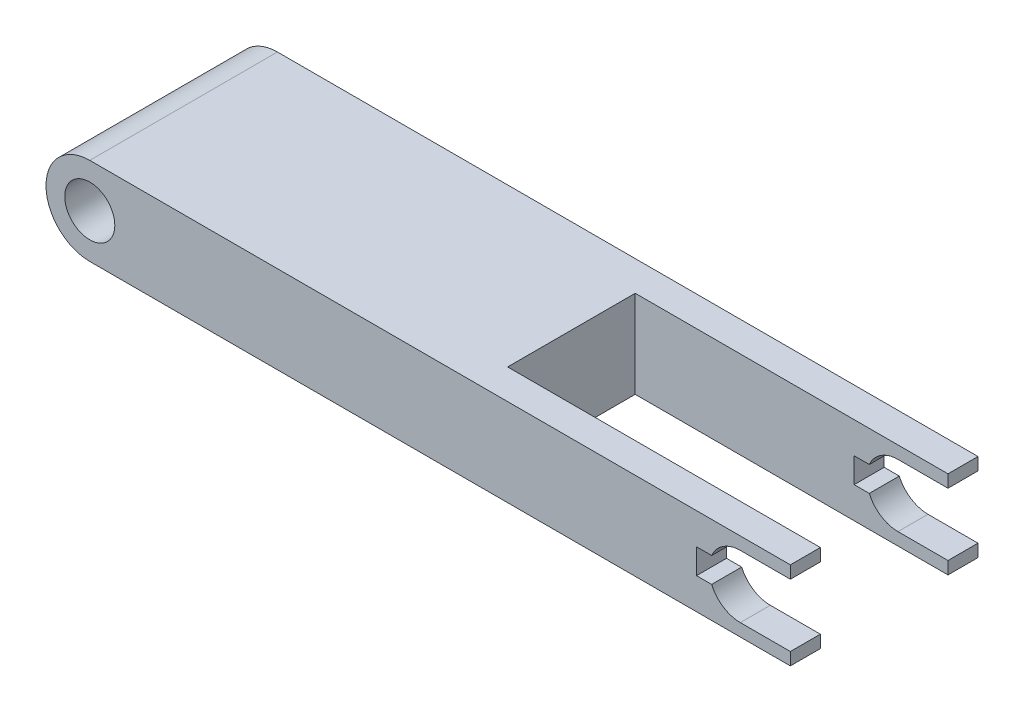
ISO-10303-21;
HEADER;
FILE_DESCRIPTION(('STEP AP214'),'2;1');
FILE_NAME('part.step','',(''),(''),'','','');
FILE_SCHEMA(('AUTOMOTIVE_DESIGN { 1 0 10303 214 1 1 1 1 }'));
ENDSEC;
DATA;
#1=APPLICATION_CONTEXT('core data for automotive mechanical design processes');
#2=APPLICATION_PROTOCOL_DEFINITION('international standard','automotive_design',2000,#1);
#3=PRODUCT_CONTEXT('',#1,'mechanical');
#4=PRODUCT('Part','Part','',(#3));
#5=PRODUCT_RELATED_PRODUCT_CATEGORY('part','',(#4));
#6=PRODUCT_DEFINITION_FORMATION('','',#4);
#7=PRODUCT_DEFINITION_CONTEXT('part definition',#1,'design');
#8=PRODUCT_DEFINITION('design','',#6,#7);
#9=PRODUCT_DEFINITION_SHAPE('','',#8);
#10=(LENGTH_UNIT() NAMED_UNIT(*) SI_UNIT(.MILLI.,.METRE.));
#11=(NAMED_UNIT(*) PLANE_ANGLE_UNIT() SI_UNIT($,.RADIAN.));
#12=(NAMED_UNIT(*) SI_UNIT($,.STERADIAN.) SOLID_ANGLE_UNIT());
#13=UNCERTAINTY_MEASURE_WITH_UNIT(LENGTH_MEASURE(1.E-05),#10,'distance_accuracy_value','');
#14=(GEOMETRIC_REPRESENTATION_CONTEXT(3) GLOBAL_UNCERTAINTY_ASSIGNED_CONTEXT((#13)) GLOBAL_UNIT_ASSIGNED_CONTEXT((#10,
#11,#12)) REPRESENTATION_CONTEXT('',''));
#15=CARTESIAN_POINT('',(0.,0.,0.));
#16=DIRECTION('',(0.,0.,1.));
#17=DIRECTION('',(1.,0.,0.));
#18=AXIS2_PLACEMENT_3D('',#15,#16,#17);
#19=CARTESIAN_POINT('',(26.,0.,-7.5));
#20=DIRECTION('',(0.,0.,1.));
#21=DIRECTION('',(1.,0.,0.));
#22=AXIS2_PLACEMENT_3D('',#19,#20,#21);
#23=CYLINDRICAL_SURFACE('',#22,2.5);
#24=CARTESIAN_POINT('',(26.,0.,7.5));
#25=DIRECTION('',(0.,0.,1.));
#26=DIRECTION('',(1.,0.,0.));
#27=AXIS2_PLACEMENT_3D('',#24,#25,#26);
#28=CIRCLE('',#27,2.5);
#29=CARTESIAN_POINT('',(26.,2.49999999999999,7.5));
#30=VERTEX_POINT('',#29);
#31=CARTESIAN_POINT('',(23.7087121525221,1.,7.5));
#32=VERTEX_POINT('',#31);
#33=EDGE_CURVE('E331',#30,#32,#28,.T.);
#34=ORIENTED_EDGE('',*,*,#33,.T.);
#35=DIRECTION('',(0.,0.,1.));
#36=VECTOR('',#35,1.);
#37=CARTESIAN_POINT('',(23.7087121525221,1.,-7.5));
#38=LINE('',#37,#36);
#39=CARTESIAN_POINT('',(23.7087121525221,1.,5.1));
#40=VERTEX_POINT('',#39);
#41=EDGE_CURVE('E317',#32,#40,#38,.F.);
#42=ORIENTED_EDGE('',*,*,#41,.T.);
#43=CARTESIAN_POINT('',(26.,0.,5.1));
#44=DIRECTION('',(0.,0.,1.));
#45=DIRECTION('',(1.,0.,0.));
#46=AXIS2_PLACEMENT_3D('',#43,#44,#45);
#47=CIRCLE('',#46,2.5);
#48=CARTESIAN_POINT('',(26.,2.49999999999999,5.1));
#49=VERTEX_POINT('',#48);
#50=EDGE_CURVE('E381',#49,#40,#47,.T.);
#51=ORIENTED_EDGE('',*,*,#50,.F.);
#52=DIRECTION('',(0.,0.,1.));
#53=VECTOR('',#52,1.);
#54=CARTESIAN_POINT('',(26.,2.49999999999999,-7.5));
#55=LINE('',#54,#53);
#56=EDGE_CURVE('E329',#30,#49,#55,.F.);
#57=ORIENTED_EDGE('',*,*,#56,.F.);
#58=EDGE_LOOP('',(#34,#42,#51,#57));
#59=FACE_BOUND('',#58,.T.);
#60=ADVANCED_FACE('F34',(#59),#23,.F.);
#61=CARTESIAN_POINT('',(26.,0.,-5.1));
#62=DIRECTION('',(0.,0.,1.));
#63=DIRECTION('',(1.,0.,0.));
#64=AXIS2_PLACEMENT_3D('',#61,#62,#63);
#65=CIRCLE('',#64,2.5);
#66=CARTESIAN_POINT('',(26.,2.49999999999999,-5.1));
#67=VERTEX_POINT('',#66);
#68=CARTESIAN_POINT('',(23.7087121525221,1.,-5.1));
#69=VERTEX_POINT('',#68);
#70=EDGE_CURVE('E340',#67,#69,#65,.T.);
#71=ORIENTED_EDGE('',*,*,#70,.T.);
#72=DIRECTION('',(0.,0.,1.));
#73=VECTOR('',#72,1.);
#74=CARTESIAN_POINT('',(23.7087121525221,1.,-7.5));
#75=LINE('',#74,#73);
#76=CARTESIAN_POINT('',(23.7087121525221,1.,-7.5));
#77=VERTEX_POINT('',#76);
#78=EDGE_CURVE('E42',#69,#77,#75,.F.);
#79=ORIENTED_EDGE('',*,*,#78,.T.);
#80=CARTESIAN_POINT('',(26.,0.,-7.5));
#81=DIRECTION('',(0.,0.,1.));
#82=DIRECTION('',(1.,0.,0.));
#83=AXIS2_PLACEMENT_3D('',#80,#81,#82);
#84=CIRCLE('',#83,2.5);
#85=CARTESIAN_POINT('',(26.,2.49999999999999,-7.5));
#86=VERTEX_POINT('',#85);
#87=EDGE_CURVE('E326',#86,#77,#84,.T.);
#88=ORIENTED_EDGE('',*,*,#87,.F.);
#89=DIRECTION('',(0.,0.,1.));
#90=VECTOR('',#89,1.);
#91=CARTESIAN_POINT('',(26.,2.49999999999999,-7.5));
#92=LINE('',#91,#90);
#93=EDGE_CURVE('E343',#67,#86,#92,.F.);
#94=ORIENTED_EDGE('',*,*,#93,.F.);
#95=EDGE_LOOP('',(#71,#79,#88,#94));
#96=FACE_BOUND('',#95,.T.);
#97=ADVANCED_FACE('F388',(#96),#23,.F.);
#98=CARTESIAN_POINT('',(26.,-3.5,7.5));
#99=DIRECTION('',(0.,1.,0.));
#100=DIRECTION('',(-1.,0.,0.));
#101=AXIS2_PLACEMENT_3D('',#98,#99,#100);
#102=PLANE('',#101);
#103=DIRECTION('',(-1.,0.,0.));
#104=VECTOR('',#103,1.);
#105=CARTESIAN_POINT('',(0.,-3.5,-5.1));
#106=LINE('',#105,#104);
#107=CARTESIAN_POINT('',(30.,-3.5,-5.1));
#108=VERTEX_POINT('',#107);
#109=CARTESIAN_POINT('',(4.99999999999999,-3.5,-5.1));
#110=VERTEX_POINT('',#109);
#111=EDGE_CURVE('E209',#108,#110,#106,.T.);
#112=ORIENTED_EDGE('',*,*,#111,.T.);
#113=DIRECTION('',(0.,0.,1.));
#114=VECTOR('',#113,1.);
#115=CARTESIAN_POINT('',(4.99999999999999,-3.5,-5.1));
#116=LINE('',#115,#114);
#117=CARTESIAN_POINT('',(4.99999999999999,-3.5,5.1));
#118=VERTEX_POINT('',#117);
#119=EDGE_CURVE('E208',#110,#118,#116,.T.);
#120=ORIENTED_EDGE('',*,*,#119,.T.);
#121=DIRECTION('',(-1.,0.,0.));
#122=VECTOR('',#121,1.);
#123=CARTESIAN_POINT('',(0.,-3.5,5.1));
#124=LINE('',#123,#122);
#125=CARTESIAN_POINT('',(30.,-3.5,5.1));
#126=VERTEX_POINT('',#125);
#127=EDGE_CURVE('E360',#126,#118,#124,.T.);
#128=ORIENTED_EDGE('',*,*,#127,.F.);
#129=DIRECTION('',(0.,0.,-1.));
#130=VECTOR('',#129,1.);
#131=CARTESIAN_POINT('',(30.,-3.5,7.5));
#132=LINE('',#131,#130);
#133=CARTESIAN_POINT('',(30.,-3.5,7.5));
#134=VERTEX_POINT('',#133);
#135=EDGE_CURVE('E254',#134,#126,#132,.T.);
#136=ORIENTED_EDGE('',*,*,#135,.F.);
#137=DIRECTION('',(1.,0.,0.));
#138=VECTOR('',#137,1.);
#139=CARTESIAN_POINT('',(26.,-3.5,7.5));
#140=LINE('',#139,#138);
#141=CARTESIAN_POINT('',(-26.,-3.5,7.5));
#142=VERTEX_POINT('',#141);
#143=EDGE_CURVE('E367',#142,#134,#140,.T.);
#144=ORIENTED_EDGE('',*,*,#143,.F.);
#145=DIRECTION('',(0.,0.,-1.));
#146=VECTOR('',#145,1.);
#147=CARTESIAN_POINT('',(-26.,-3.5,7.5));
#148=LINE('',#147,#146);
#149=CARTESIAN_POINT('',(-26.,-3.5,-7.5));
#150=VERTEX_POINT('',#149);
#151=EDGE_CURVE('E377',#142,#150,#148,.T.);
#152=ORIENTED_EDGE('',*,*,#151,.T.);
#153=DIRECTION('',(1.,0.,0.));
#154=VECTOR('',#153,1.);
#155=CARTESIAN_POINT('',(26.,-3.5,-7.5));
#156=LINE('',#155,#154);
#157=CARTESIAN_POINT('',(30.,-3.5,-7.5));
#158=VERTEX_POINT('',#157);
#159=EDGE_CURVE('E364',#150,#158,#156,.T.);
#160=ORIENTED_EDGE('',*,*,#159,.T.);
#161=DIRECTION('',(0.,0.,-1.));
#162=VECTOR('',#161,1.);
#163=CARTESIAN_POINT('',(30.,-3.5,-5.1));
#164=LINE('',#163,#162);
#165=EDGE_CURVE('E238',#108,#158,#164,.T.);
#166=ORIENTED_EDGE('',*,*,#165,.F.);
#167=EDGE_LOOP('',(#112,#120,#128,#136,#144,#152,#160,#166));
#168=FACE_BOUND('',#167,.T.);
#169=ADVANCED_FACE('F36',(#168),#102,.F.);
#170=CARTESIAN_POINT('',(26.,3.5,7.5));
#171=DIRECTION('',(0.,-1.,0.));
#172=DIRECTION('',(1.,0.,0.));
#173=AXIS2_PLACEMENT_3D('',#170,#171,#172);
#174=PLANE('',#173);
#175=DIRECTION('',(-1.,0.,0.));
#176=VECTOR('',#175,1.);
#177=CARTESIAN_POINT('',(0.,3.5,-5.1));
#178=LINE('',#177,#176);
#179=CARTESIAN_POINT('',(30.,3.5,-5.1));
#180=VERTEX_POINT('',#179);
#181=CARTESIAN_POINT('',(4.99999999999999,3.5,-5.1));
#182=VERTEX_POINT('',#181);
#183=EDGE_CURVE('E197',#180,#182,#178,.T.);
#184=ORIENTED_EDGE('',*,*,#183,.F.);
#185=DIRECTION('',(0.,0.,1.));
#186=VECTOR('',#185,1.);
#187=CARTESIAN_POINT('',(30.,3.5,-7.5));
#188=LINE('',#187,#186);
#189=CARTESIAN_POINT('',(30.,3.5,-7.5));
#190=VERTEX_POINT('',#189);
#191=EDGE_CURVE('E202',#190,#180,#188,.T.);
#192=ORIENTED_EDGE('',*,*,#191,.F.);
#193=DIRECTION('',(-1.,0.,0.));
#194=VECTOR('',#193,1.);
#195=CARTESIAN_POINT('',(26.,3.5,-7.5));
#196=LINE('',#195,#194);
#197=CARTESIAN_POINT('',(-26.,3.5,-7.5));
#198=VERTEX_POINT('',#197);
#199=EDGE_CURVE('E370',#190,#198,#196,.T.);
#200=ORIENTED_EDGE('',*,*,#199,.T.);
#201=DIRECTION('',(0.,0.,-1.));
#202=VECTOR('',#201,1.);
#203=CARTESIAN_POINT('',(-26.,3.5,7.5));
#204=LINE('',#203,#202);
#205=CARTESIAN_POINT('',(-26.,3.5,7.5));
#206=VERTEX_POINT('',#205);
#207=EDGE_CURVE('E373',#206,#198,#204,.T.);
#208=ORIENTED_EDGE('',*,*,#207,.F.);
#209=DIRECTION('',(-1.,0.,0.));
#210=VECTOR('',#209,1.);
#211=CARTESIAN_POINT('',(26.,3.5,7.5));
#212=LINE('',#211,#210);
#213=CARTESIAN_POINT('',(30.,3.5,7.5));
#214=VERTEX_POINT('',#213);
#215=EDGE_CURVE('E369',#214,#206,#212,.T.);
#216=ORIENTED_EDGE('',*,*,#215,.F.);
#217=DIRECTION('',(0.,0.,1.));
#218=VECTOR('',#217,1.);
#219=CARTESIAN_POINT('',(30.,3.5,5.1));
#220=LINE('',#219,#218);
#221=CARTESIAN_POINT('',(30.,3.5,5.1));
#222=VERTEX_POINT('',#221);
#223=EDGE_CURVE('E270',#222,#214,#220,.T.);
#224=ORIENTED_EDGE('',*,*,#223,.F.);
#225=DIRECTION('',(-1.,0.,0.));
#226=VECTOR('',#225,1.);
#227=CARTESIAN_POINT('',(0.,3.5,5.1));
#228=LINE('',#227,#226);
#229=CARTESIAN_POINT('',(5.,3.5,5.1));
#230=VERTEX_POINT('',#229);
#231=EDGE_CURVE('E355',#222,#230,#228,.T.);
#232=ORIENTED_EDGE('',*,*,#231,.T.);
#233=DIRECTION('',(0.,0.,1.));
#234=VECTOR('',#233,1.);
#235=CARTESIAN_POINT('',(4.99999999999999,3.5,-5.1));
#236=LINE('',#235,#234);
#237=EDGE_CURVE('E205',#182,#230,#236,.T.);
#238=ORIENTED_EDGE('',*,*,#237,.F.);
#239=EDGE_LOOP('',(#184,#192,#200,#208,#216,#224,#232,#238));
#240=FACE_BOUND('',#239,.T.);
#241=ADVANCED_FACE('F199',(#240),#174,.F.);
#242=CARTESIAN_POINT('',(0.,0.,7.5));
#243=DIRECTION('',(0.,0.,-1.));
#244=DIRECTION('',(-1.,0.,0.));
#245=AXIS2_PLACEMENT_3D('',#242,#243,#244);
#246=PLANE('',#245);
#247=CARTESIAN_POINT('',(-26.,0.,7.5));
#248=DIRECTION('',(0.,0.,1.));
#249=DIRECTION('',(1.,0.,0.));
#250=AXIS2_PLACEMENT_3D('',#247,#248,#249);
#251=CIRCLE('',#250,2.);
#252=CARTESIAN_POINT('',(-24.,0.,7.5));
#253=VERTEX_POINT('',#252);
#254=EDGE_CURVE('E228',#253,#253,#251,.T.);
#255=ORIENTED_EDGE('',*,*,#254,.F.);
#256=EDGE_LOOP('',(#255));
#257=FACE_BOUND('',#256,.T.);
#258=DIRECTION('',(0.,-1.,0.));
#259=VECTOR('',#258,1.);
#260=CARTESIAN_POINT('',(22.5,1.,7.5));
#261=LINE('',#260,#259);
#262=CARTESIAN_POINT('',(22.5,1.,7.5));
#263=VERTEX_POINT('',#262);
#264=CARTESIAN_POINT('',(22.5,-0.999999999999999,7.5));
#265=VERTEX_POINT('',#264);
#266=EDGE_CURVE('E286',#263,#265,#261,.T.);
#267=ORIENTED_EDGE('',*,*,#266,.F.);
#268=DIRECTION('',(-1.,0.,0.));
#269=VECTOR('',#268,1.);
#270=CARTESIAN_POINT('',(24.5,1.,7.5));
#271=LINE('',#270,#269);
#272=EDGE_CURVE('E291',#32,#263,#271,.T.);
#273=ORIENTED_EDGE('',*,*,#272,.F.);
#274=ORIENTED_EDGE('',*,*,#33,.F.);
#275=DIRECTION('',(-1.,0.,0.));
#276=VECTOR('',#275,1.);
#277=CARTESIAN_POINT('',(30.,2.49999999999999,7.5));
#278=LINE('',#277,#276);
#279=CARTESIAN_POINT('',(30.,2.49999999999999,7.5));
#280=VERTEX_POINT('',#279);
#281=EDGE_CURVE('E283',#280,#30,#278,.T.);
#282=ORIENTED_EDGE('',*,*,#281,.F.);
#283=DIRECTION('',(0.,-1.,0.));
#284=VECTOR('',#283,1.);
#285=CARTESIAN_POINT('',(30.,3.5,7.5));
#286=LINE('',#285,#284);
#287=EDGE_CURVE('E273',#214,#280,#286,.T.);
#288=ORIENTED_EDGE('',*,*,#287,.F.);
#289=ORIENTED_EDGE('',*,*,#215,.T.);
#290=CARTESIAN_POINT('',(-26.,0.,7.5));
#291=DIRECTION('',(0.,0.,1.));
#292=DIRECTION('',(1.,0.,0.));
#293=AXIS2_PLACEMENT_3D('',#290,#291,#292);
#294=CIRCLE('',#293,3.5);
#295=EDGE_CURVE('E348',#206,#142,#294,.T.);
#296=ORIENTED_EDGE('',*,*,#295,.T.);
#297=ORIENTED_EDGE('',*,*,#143,.T.);
#298=DIRECTION('',(0.,-1.,0.));
#299=VECTOR('',#298,1.);
#300=CARTESIAN_POINT('',(30.,-2.50000000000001,7.5));
#301=LINE('',#300,#299);
#302=CARTESIAN_POINT('',(30.,-2.50000000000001,7.5));
#303=VERTEX_POINT('',#302);
#304=EDGE_CURVE('E261',#303,#134,#301,.T.);
#305=ORIENTED_EDGE('',*,*,#304,.F.);
#306=DIRECTION('',(-1.,0.,0.));
#307=VECTOR('',#306,1.);
#308=CARTESIAN_POINT('',(30.,-2.50000000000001,7.5));
#309=LINE('',#308,#307);
#310=CARTESIAN_POINT('',(26.,-2.50000000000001,7.5));
#311=VERTEX_POINT('',#310);
#312=EDGE_CURVE('E264',#303,#311,#309,.T.);
#313=ORIENTED_EDGE('',*,*,#312,.T.);
#314=CARTESIAN_POINT('',(23.7087121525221,-0.999999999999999,7.5));
#315=VERTEX_POINT('',#314);
#316=EDGE_CURVE('E325',#315,#311,#28,.T.);
#317=ORIENTED_EDGE('',*,*,#316,.F.);
#318=DIRECTION('',(1.,0.,0.));
#319=VECTOR('',#318,1.);
#320=CARTESIAN_POINT('',(24.5,-0.999999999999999,7.5));
#321=LINE('',#320,#319);
#322=EDGE_CURVE('E49',#265,#315,#321,.T.);
#323=ORIENTED_EDGE('',*,*,#322,.F.);
#324=EDGE_LOOP('',(#267,#273,#274,#282,#288,#289,#296,#297,#305,#313,#317,#323));
#325=FACE_BOUND('',#324,.T.);
#326=ADVANCED_FACE('F431',(#257,#325),#246,.F.);
#327=CARTESIAN_POINT('',(0.,0.,-7.5));
#328=DIRECTION('',(0.,0.,-1.));
#329=DIRECTION('',(-1.,0.,0.));
#330=AXIS2_PLACEMENT_3D('',#327,#328,#329);
#331=PLANE('',#330);
#332=CARTESIAN_POINT('',(-26.,0.,-7.5));
#333=DIRECTION('',(0.,0.,1.));
#334=DIRECTION('',(1.,0.,0.));
#335=AXIS2_PLACEMENT_3D('',#332,#333,#334);
#336=CIRCLE('',#335,2.);
#337=CARTESIAN_POINT('',(-24.,0.,-7.5));
#338=VERTEX_POINT('',#337);
#339=EDGE_CURVE('E225',#338,#338,#336,.T.);
#340=ORIENTED_EDGE('',*,*,#339,.T.);
#341=EDGE_LOOP('',(#340));
#342=FACE_BOUND('',#341,.T.);
#343=DIRECTION('',(-1.,0.,0.));
#344=VECTOR('',#343,1.);
#345=CARTESIAN_POINT('',(24.5,1.,-7.5));
#346=LINE('',#345,#344);
#347=CARTESIAN_POINT('',(22.5,1.,-7.5));
#348=VERTEX_POINT('',#347);
#349=EDGE_CURVE('E294',#77,#348,#346,.T.);
#350=ORIENTED_EDGE('',*,*,#349,.T.);
#351=DIRECTION('',(0.,-1.,0.));
#352=VECTOR('',#351,1.);
#353=CARTESIAN_POINT('',(22.5,1.,-7.5));
#354=LINE('',#353,#352);
#355=CARTESIAN_POINT('',(22.5,-0.999999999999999,-7.5));
#356=VERTEX_POINT('',#355);
#357=EDGE_CURVE('E287',#348,#356,#354,.T.);
#358=ORIENTED_EDGE('',*,*,#357,.T.);
#359=DIRECTION('',(1.,0.,0.));
#360=VECTOR('',#359,1.);
#361=CARTESIAN_POINT('',(24.5,-0.999999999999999,-7.5));
#362=LINE('',#361,#360);
#363=CARTESIAN_POINT('',(23.7087121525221,-0.999999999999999,-7.5));
#364=VERTEX_POINT('',#363);
#365=EDGE_CURVE('E290',#356,#364,#362,.T.);
#366=ORIENTED_EDGE('',*,*,#365,.T.);
#367=CARTESIAN_POINT('',(26.,-2.50000000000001,-7.5));
#368=VERTEX_POINT('',#367);
#369=EDGE_CURVE('E330',#364,#368,#84,.T.);
#370=ORIENTED_EDGE('',*,*,#369,.T.);
#371=DIRECTION('',(-1.,0.,0.));
#372=VECTOR('',#371,1.);
#373=CARTESIAN_POINT('',(30.,-2.50000000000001,-7.5));
#374=LINE('',#373,#372);
#375=CARTESIAN_POINT('',(30.,-2.50000000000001,-7.5));
#376=VERTEX_POINT('',#375);
#377=EDGE_CURVE('E251',#376,#368,#374,.T.);
#378=ORIENTED_EDGE('',*,*,#377,.F.);
#379=DIRECTION('',(0.,1.,0.));
#380=VECTOR('',#379,1.);
#381=CARTESIAN_POINT('',(30.,-3.5,-7.5));
#382=LINE('',#381,#380);
#383=EDGE_CURVE('E241',#158,#376,#382,.T.);
#384=ORIENTED_EDGE('',*,*,#383,.F.);
#385=ORIENTED_EDGE('',*,*,#159,.F.);
#386=CARTESIAN_POINT('',(-26.,0.,-7.5));
#387=DIRECTION('',(0.,0.,1.));
#388=DIRECTION('',(1.,0.,0.));
#389=AXIS2_PLACEMENT_3D('',#386,#387,#388);
#390=CIRCLE('',#389,3.5);
#391=EDGE_CURVE('E349',#198,#150,#390,.T.);
#392=ORIENTED_EDGE('',*,*,#391,.F.);
#393=ORIENTED_EDGE('',*,*,#199,.F.);
#394=DIRECTION('',(0.,1.,0.));
#395=VECTOR('',#394,1.);
#396=CARTESIAN_POINT('',(30.,2.49999999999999,-7.5));
#397=LINE('',#396,#395);
#398=CARTESIAN_POINT('',(30.,2.49999999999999,-7.5));
#399=VERTEX_POINT('',#398);
#400=EDGE_CURVE('E224',#399,#190,#397,.T.);
#401=ORIENTED_EDGE('',*,*,#400,.F.);
#402=DIRECTION('',(-1.,0.,0.));
#403=VECTOR('',#402,1.);
#404=CARTESIAN_POINT('',(30.,2.49999999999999,-7.5));
#405=LINE('',#404,#403);
#406=EDGE_CURVE('E234',#399,#86,#405,.T.);
#407=ORIENTED_EDGE('',*,*,#406,.T.);
#408=ORIENTED_EDGE('',*,*,#87,.T.);
#409=EDGE_LOOP('',(#350,#358,#366,#370,#378,#384,#385,#392,#393,#401,#407,#408));
#410=FACE_BOUND('',#409,.T.);
#411=ADVANCED_FACE('F392',(#342,#410),#331,.T.);
#412=CARTESIAN_POINT('',(0.,0.,-5.1));
#413=DIRECTION('',(0.,0.,1.));
#414=DIRECTION('',(1.,0.,0.));
#415=AXIS2_PLACEMENT_3D('',#412,#413,#414);
#416=PLANE('',#415);
#417=DIRECTION('',(-1.,0.,0.));
#418=VECTOR('',#417,1.);
#419=CARTESIAN_POINT('',(0.,0.999999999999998,-5.1));
#420=LINE('',#419,#418);
#421=CARTESIAN_POINT('',(22.5,1.,-5.1));
#422=VERTEX_POINT('',#421);
#423=EDGE_CURVE('E315',#69,#422,#420,.T.);
#424=ORIENTED_EDGE('',*,*,#423,.F.);
#425=ORIENTED_EDGE('',*,*,#70,.F.);
#426=DIRECTION('',(-1.,0.,0.));
#427=VECTOR('',#426,1.);
#428=CARTESIAN_POINT('',(30.,2.49999999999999,-5.1));
#429=LINE('',#428,#427);
#430=CARTESIAN_POINT('',(30.,2.49999999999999,-5.1));
#431=VERTEX_POINT('',#430);
#432=EDGE_CURVE('E216',#431,#67,#429,.T.);
#433=ORIENTED_EDGE('',*,*,#432,.F.);
#434=DIRECTION('',(0.,-1.,0.));
#435=VECTOR('',#434,1.);
#436=CARTESIAN_POINT('',(30.,3.5,-5.1));
#437=LINE('',#436,#435);
#438=EDGE_CURVE('E212',#180,#431,#437,.T.);
#439=ORIENTED_EDGE('',*,*,#438,.F.);
#440=ORIENTED_EDGE('',*,*,#183,.T.);
#441=DIRECTION('',(0.,-1.,0.));
#442=VECTOR('',#441,1.);
#443=CARTESIAN_POINT('',(4.99999999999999,0.,-5.1));
#444=LINE('',#443,#442);
#445=EDGE_CURVE('E353',#182,#110,#444,.T.);
#446=ORIENTED_EDGE('',*,*,#445,.T.);
#447=ORIENTED_EDGE('',*,*,#111,.F.);
#448=DIRECTION('',(0.,-1.,0.));
#449=VECTOR('',#448,1.);
#450=CARTESIAN_POINT('',(30.,-2.50000000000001,-5.1));
#451=LINE('',#450,#449);
#452=CARTESIAN_POINT('',(30.,-2.50000000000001,-5.1));
#453=VERTEX_POINT('',#452);
#454=EDGE_CURVE('E245',#453,#108,#451,.T.);
#455=ORIENTED_EDGE('',*,*,#454,.F.);
#456=DIRECTION('',(-1.,0.,0.));
#457=VECTOR('',#456,1.);
#458=CARTESIAN_POINT('',(30.,-2.50000000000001,-5.1));
#459=LINE('',#458,#457);
#460=CARTESIAN_POINT('',(26.,-2.50000000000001,-5.1));
#461=VERTEX_POINT('',#460);
#462=EDGE_CURVE('E248',#453,#461,#459,.T.);
#463=ORIENTED_EDGE('',*,*,#462,.T.);
#464=CARTESIAN_POINT('',(23.7087121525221,-0.999999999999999,-5.1));
#465=VERTEX_POINT('',#464);
#466=EDGE_CURVE('E339',#465,#461,#65,.T.);
#467=ORIENTED_EDGE('',*,*,#466,.F.);
#468=DIRECTION('',(1.,0.,0.));
#469=VECTOR('',#468,1.);
#470=CARTESIAN_POINT('',(0.,-0.999999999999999,-5.1));
#471=LINE('',#470,#469);
#472=CARTESIAN_POINT('',(22.5,-0.999999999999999,-5.1));
#473=VERTEX_POINT('',#472);
#474=EDGE_CURVE('E57',#473,#465,#471,.T.);
#475=ORIENTED_EDGE('',*,*,#474,.F.);
#476=DIRECTION('',(0.,-1.,0.));
#477=VECTOR('',#476,1.);
#478=CARTESIAN_POINT('',(22.5,0.,-5.1));
#479=LINE('',#478,#477);
#480=EDGE_CURVE('E323',#422,#473,#479,.T.);
#481=ORIENTED_EDGE('',*,*,#480,.F.);
#482=EDGE_LOOP('',(#424,#425,#433,#439,#440,#446,#447,#455,#463,#467,#475,#481));
#483=FACE_BOUND('',#482,.T.);
#484=ADVANCED_FACE('F214',(#483),#416,.T.);
#485=CARTESIAN_POINT('',(0.,0.,5.1));
#486=DIRECTION('',(0.,0.,1.));
#487=DIRECTION('',(1.,0.,0.));
#488=AXIS2_PLACEMENT_3D('',#485,#486,#487);
#489=PLANE('',#488);
#490=ORIENTED_EDGE('',*,*,#50,.T.);
#491=DIRECTION('',(-1.,0.,0.));
#492=VECTOR('',#491,1.);
#493=CARTESIAN_POINT('',(0.,0.999999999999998,5.1));
#494=LINE('',#493,#492);
#495=CARTESIAN_POINT('',(22.5,1.,5.1));
#496=VERTEX_POINT('',#495);
#497=EDGE_CURVE('E320',#40,#496,#494,.T.);
#498=ORIENTED_EDGE('',*,*,#497,.T.);
#499=DIRECTION('',(0.,-1.,0.));
#500=VECTOR('',#499,1.);
#501=CARTESIAN_POINT('',(22.5,0.,5.1));
#502=LINE('',#501,#500);
#503=CARTESIAN_POINT('',(22.5,-0.999999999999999,5.1));
#504=VERTEX_POINT('',#503);
#505=EDGE_CURVE('E11',#496,#504,#502,.T.);
#506=ORIENTED_EDGE('',*,*,#505,.T.);
#507=DIRECTION('',(1.,0.,0.));
#508=VECTOR('',#507,1.);
#509=CARTESIAN_POINT('',(0.,-0.999999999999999,5.1));
#510=LINE('',#509,#508);
#511=CARTESIAN_POINT('',(23.7087121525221,-0.999999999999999,5.1));
#512=VERTEX_POINT('',#511);
#513=EDGE_CURVE('E312',#504,#512,#510,.T.);
#514=ORIENTED_EDGE('',*,*,#513,.T.);
#515=CARTESIAN_POINT('',(26.,-2.50000000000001,5.1));
#516=VERTEX_POINT('',#515);
#517=EDGE_CURVE('E380',#512,#516,#47,.T.);
#518=ORIENTED_EDGE('',*,*,#517,.T.);
#519=DIRECTION('',(-1.,0.,0.));
#520=VECTOR('',#519,1.);
#521=CARTESIAN_POINT('',(30.,-2.50000000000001,5.1));
#522=LINE('',#521,#520);
#523=CARTESIAN_POINT('',(30.,-2.50000000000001,5.1));
#524=VERTEX_POINT('',#523);
#525=EDGE_CURVE('E267',#524,#516,#522,.T.);
#526=ORIENTED_EDGE('',*,*,#525,.F.);
#527=DIRECTION('',(0.,1.,0.));
#528=VECTOR('',#527,1.);
#529=CARTESIAN_POINT('',(30.,-3.5,5.1));
#530=LINE('',#529,#528);
#531=EDGE_CURVE('E257',#126,#524,#530,.T.);
#532=ORIENTED_EDGE('',*,*,#531,.F.);
#533=ORIENTED_EDGE('',*,*,#127,.T.);
#534=DIRECTION('',(0.,-1.,0.));
#535=VECTOR('',#534,1.);
#536=CARTESIAN_POINT('',(4.99999999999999,0.,5.1));
#537=LINE('',#536,#535);
#538=EDGE_CURVE('E351',#230,#118,#537,.T.);
#539=ORIENTED_EDGE('',*,*,#538,.F.);
#540=ORIENTED_EDGE('',*,*,#231,.F.);
#541=DIRECTION('',(0.,1.,0.));
#542=VECTOR('',#541,1.);
#543=CARTESIAN_POINT('',(30.,2.49999999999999,5.1));
#544=LINE('',#543,#542);
#545=CARTESIAN_POINT('',(30.,2.49999999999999,5.1));
#546=VERTEX_POINT('',#545);
#547=EDGE_CURVE('E277',#546,#222,#544,.T.);
#548=ORIENTED_EDGE('',*,*,#547,.F.);
#549=DIRECTION('',(-1.,0.,0.));
#550=VECTOR('',#549,1.);
#551=CARTESIAN_POINT('',(30.,2.49999999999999,5.1));
#552=LINE('',#551,#550);
#553=EDGE_CURVE('E280',#546,#49,#552,.T.);
#554=ORIENTED_EDGE('',*,*,#553,.T.);
#555=EDGE_LOOP('',(#490,#498,#506,#514,#518,#526,#532,#533,#539,#540,#548,#554));
#556=FACE_BOUND('',#555,.T.);
#557=ADVANCED_FACE('F439',(#556),#489,.F.);
#558=CARTESIAN_POINT('',(4.99999999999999,0.,-5.1));
#559=DIRECTION('',(-1.,0.,0.));
#560=DIRECTION('',(0.,-1.,0.));
#561=AXIS2_PLACEMENT_3D('',#558,#559,#560);
#562=PLANE('',#561);
#563=ORIENTED_EDGE('',*,*,#538,.T.);
#564=ORIENTED_EDGE('',*,*,#119,.F.);
#565=ORIENTED_EDGE('',*,*,#445,.F.);
#566=ORIENTED_EDGE('',*,*,#237,.T.);
#567=EDGE_LOOP('',(#563,#564,#565,#566));
#568=FACE_BOUND('',#567,.T.);
#569=ADVANCED_FACE('F442',(#568),#562,.F.);
#570=CARTESIAN_POINT('',(-26.,0.,-7.5));
#571=DIRECTION('',(0.,0.,1.));
#572=DIRECTION('',(1.,0.,0.));
#573=AXIS2_PLACEMENT_3D('',#570,#571,#572);
#574=CYLINDRICAL_SURFACE('',#573,3.5);
#575=ORIENTED_EDGE('',*,*,#207,.T.);
#576=ORIENTED_EDGE('',*,*,#391,.T.);
#577=ORIENTED_EDGE('',*,*,#151,.F.);
#578=ORIENTED_EDGE('',*,*,#295,.F.);
#579=EDGE_LOOP('',(#575,#576,#577,#578));
#580=FACE_BOUND('',#579,.T.);
#581=ADVANCED_FACE('F424',(#580),#574,.T.);
#582=ORIENTED_EDGE('',*,*,#517,.F.);
#583=DIRECTION('',(0.,0.,1.));
#584=VECTOR('',#583,1.);
#585=CARTESIAN_POINT('',(23.7087121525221,-0.999999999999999,-7.5));
#586=LINE('',#585,#584);
#587=EDGE_CURVE('E310',#512,#315,#586,.T.);
#588=ORIENTED_EDGE('',*,*,#587,.T.);
#589=ORIENTED_EDGE('',*,*,#316,.T.);
#590=DIRECTION('',(0.,0.,1.));
#591=VECTOR('',#590,1.);
#592=CARTESIAN_POINT('',(26.,-2.50000000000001,-7.5));
#593=LINE('',#592,#591);
#594=EDGE_CURVE('E336',#516,#311,#593,.T.);
#595=ORIENTED_EDGE('',*,*,#594,.F.);
#596=EDGE_LOOP('',(#582,#588,#589,#595));
#597=FACE_BOUND('',#596,.T.);
#598=ADVANCED_FACE('F455',(#597),#23,.F.);
#599=ORIENTED_EDGE('',*,*,#369,.F.);
#600=DIRECTION('',(0.,0.,1.));
#601=VECTOR('',#600,1.);
#602=CARTESIAN_POINT('',(23.7087121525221,-0.999999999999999,-7.5));
#603=LINE('',#602,#601);
#604=EDGE_CURVE('E384',#364,#465,#603,.T.);
#605=ORIENTED_EDGE('',*,*,#604,.T.);
#606=ORIENTED_EDGE('',*,*,#466,.T.);
#607=DIRECTION('',(0.,0.,1.));
#608=VECTOR('',#607,1.);
#609=CARTESIAN_POINT('',(26.,-2.50000000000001,-7.5));
#610=LINE('',#609,#608);
#611=EDGE_CURVE('E345',#368,#461,#610,.T.);
#612=ORIENTED_EDGE('',*,*,#611,.F.);
#613=EDGE_LOOP('',(#599,#605,#606,#612));
#614=FACE_BOUND('',#613,.T.);
#615=ADVANCED_FACE('F406',(#614),#23,.F.);
#616=CARTESIAN_POINT('',(24.5,-0.999999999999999,-7.5));
#617=DIRECTION('',(0.,-1.,0.));
#618=DIRECTION('',(0.,0.,-1.));
#619=AXIS2_PLACEMENT_3D('',#616,#617,#618);
#620=PLANE('',#619);
#621=ORIENTED_EDGE('',*,*,#474,.T.);
#622=ORIENTED_EDGE('',*,*,#604,.F.);
#623=ORIENTED_EDGE('',*,*,#365,.F.);
#624=DIRECTION('',(0.,0.,1.));
#625=VECTOR('',#624,1.);
#626=CARTESIAN_POINT('',(22.5,-0.999999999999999,-7.5));
#627=LINE('',#626,#625);
#628=EDGE_CURVE('E307',#356,#473,#627,.T.);
#629=ORIENTED_EDGE('',*,*,#628,.T.);
#630=EDGE_LOOP('',(#621,#622,#623,#629));
#631=FACE_BOUND('',#630,.T.);
#632=ADVANCED_FACE('F475',(#631),#620,.F.);
#633=CARTESIAN_POINT('',(24.5,1.,-7.5));
#634=DIRECTION('',(0.,1.,0.));
#635=DIRECTION('',(-1.,0.,0.));
#636=AXIS2_PLACEMENT_3D('',#633,#634,#635);
#637=PLANE('',#636);
#638=ORIENTED_EDGE('',*,*,#423,.T.);
#639=DIRECTION('',(0.,0.,1.));
#640=VECTOR('',#639,1.);
#641=CARTESIAN_POINT('',(22.5,1.,-7.5));
#642=LINE('',#641,#640);
#643=EDGE_CURVE('E303',#348,#422,#642,.T.);
#644=ORIENTED_EDGE('',*,*,#643,.F.);
#645=ORIENTED_EDGE('',*,*,#349,.F.);
#646=ORIENTED_EDGE('',*,*,#78,.F.);
#647=EDGE_LOOP('',(#638,#644,#645,#646));
#648=FACE_BOUND('',#647,.T.);
#649=ADVANCED_FACE('F397',(#648),#637,.F.);
#650=CARTESIAN_POINT('',(22.5,1.,-7.5));
#651=DIRECTION('',(-1.,0.,0.));
#652=DIRECTION('',(0.,0.,1.));
#653=AXIS2_PLACEMENT_3D('',#650,#651,#652);
#654=PLANE('',#653);
#655=ORIENTED_EDGE('',*,*,#480,.T.);
#656=ORIENTED_EDGE('',*,*,#628,.F.);
#657=ORIENTED_EDGE('',*,*,#357,.F.);
#658=ORIENTED_EDGE('',*,*,#643,.T.);
#659=EDGE_LOOP('',(#655,#656,#657,#658));
#660=FACE_BOUND('',#659,.T.);
#661=ADVANCED_FACE('F400',(#660),#654,.F.);
#662=EDGE_CURVE('E306',#496,#263,#642,.T.);
#663=ORIENTED_EDGE('',*,*,#662,.T.);
#664=ORIENTED_EDGE('',*,*,#266,.T.);
#665=EDGE_CURVE('E297',#504,#265,#627,.T.);
#666=ORIENTED_EDGE('',*,*,#665,.F.);
#667=ORIENTED_EDGE('',*,*,#505,.F.);
#668=EDGE_LOOP('',(#663,#664,#666,#667));
#669=FACE_BOUND('',#668,.T.);
#670=ADVANCED_FACE('F460',(#669),#654,.F.);
#671=ORIENTED_EDGE('',*,*,#41,.F.);
#672=ORIENTED_EDGE('',*,*,#272,.T.);
#673=ORIENTED_EDGE('',*,*,#662,.F.);
#674=ORIENTED_EDGE('',*,*,#497,.F.);
#675=EDGE_LOOP('',(#671,#672,#673,#674));
#676=FACE_BOUND('',#675,.T.);
#677=ADVANCED_FACE('F462',(#676),#637,.F.);
#678=ORIENTED_EDGE('',*,*,#665,.T.);
#679=ORIENTED_EDGE('',*,*,#322,.T.);
#680=ORIENTED_EDGE('',*,*,#587,.F.);
#681=ORIENTED_EDGE('',*,*,#513,.F.);
#682=EDGE_LOOP('',(#678,#679,#680,#681));
#683=FACE_BOUND('',#682,.T.);
#684=ADVANCED_FACE('F456',(#683),#620,.F.);
#685=CARTESIAN_POINT('',(30.,2.49999999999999,7.5));
#686=DIRECTION('',(0.,1.,0.));
#687=DIRECTION('',(0.,0.,1.));
#688=AXIS2_PLACEMENT_3D('',#685,#686,#687);
#689=PLANE('',#688);
#690=ORIENTED_EDGE('',*,*,#56,.T.);
#691=ORIENTED_EDGE('',*,*,#553,.F.);
#692=DIRECTION('',(0.,0.,-1.));
#693=VECTOR('',#692,1.);
#694=CARTESIAN_POINT('',(30.,2.49999999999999,7.5));
#695=LINE('',#694,#693);
#696=EDGE_CURVE('E275',#280,#546,#695,.T.);
#697=ORIENTED_EDGE('',*,*,#696,.F.);
#698=ORIENTED_EDGE('',*,*,#281,.T.);
#699=EDGE_LOOP('',(#690,#691,#697,#698));
#700=FACE_BOUND('',#699,.T.);
#701=ADVANCED_FACE('F466',(#700),#689,.F.);
#702=CARTESIAN_POINT('',(30.,0.,0.));
#703=DIRECTION('',(1.,0.,0.));
#704=DIRECTION('',(0.,0.,-1.));
#705=AXIS2_PLACEMENT_3D('',#702,#703,#704);
#706=PLANE('',#705);
#707=ORIENTED_EDGE('',*,*,#223,.T.);
#708=ORIENTED_EDGE('',*,*,#287,.T.);
#709=ORIENTED_EDGE('',*,*,#696,.T.);
#710=ORIENTED_EDGE('',*,*,#547,.T.);
#711=EDGE_LOOP('',(#707,#708,#709,#710));
#712=FACE_BOUND('',#711,.T.);
#713=ADVANCED_FACE('F435',(#712),#706,.T.);
#714=CARTESIAN_POINT('',(30.,-2.50000000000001,5.1));
#715=DIRECTION('',(0.,-1.,0.));
#716=DIRECTION('',(0.,0.,-1.));
#717=AXIS2_PLACEMENT_3D('',#714,#715,#716);
#718=PLANE('',#717);
#719=ORIENTED_EDGE('',*,*,#594,.T.);
#720=ORIENTED_EDGE('',*,*,#312,.F.);
#721=DIRECTION('',(0.,0.,1.));
#722=VECTOR('',#721,1.);
#723=CARTESIAN_POINT('',(30.,-2.50000000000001,5.1));
#724=LINE('',#723,#722);
#725=EDGE_CURVE('E259',#524,#303,#724,.T.);
#726=ORIENTED_EDGE('',*,*,#725,.F.);
#727=ORIENTED_EDGE('',*,*,#525,.T.);
#728=EDGE_LOOP('',(#719,#720,#726,#727));
#729=FACE_BOUND('',#728,.T.);
#730=ADVANCED_FACE('F451',(#729),#718,.F.);
#731=CARTESIAN_POINT('',(30.,0.,0.));
#732=DIRECTION('',(1.,0.,0.));
#733=DIRECTION('',(0.,0.,-1.));
#734=AXIS2_PLACEMENT_3D('',#731,#732,#733);
#735=PLANE('',#734);
#736=ORIENTED_EDGE('',*,*,#135,.T.);
#737=ORIENTED_EDGE('',*,*,#531,.T.);
#738=ORIENTED_EDGE('',*,*,#725,.T.);
#739=ORIENTED_EDGE('',*,*,#304,.T.);
#740=EDGE_LOOP('',(#736,#737,#738,#739));
#741=FACE_BOUND('',#740,.T.);
#742=ADVANCED_FACE('F446',(#741),#735,.T.);
#743=CARTESIAN_POINT('',(30.,-2.50000000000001,-7.5));
#744=DIRECTION('',(0.,-1.,0.));
#745=DIRECTION('',(0.,0.,-1.));
#746=AXIS2_PLACEMENT_3D('',#743,#744,#745);
#747=PLANE('',#746);
#748=ORIENTED_EDGE('',*,*,#611,.T.);
#749=ORIENTED_EDGE('',*,*,#462,.F.);
#750=DIRECTION('',(0.,0.,1.));
#751=VECTOR('',#750,1.);
#752=CARTESIAN_POINT('',(30.,-2.50000000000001,-7.5));
#753=LINE('',#752,#751);
#754=EDGE_CURVE('E243',#376,#453,#753,.T.);
#755=ORIENTED_EDGE('',*,*,#754,.F.);
#756=ORIENTED_EDGE('',*,*,#377,.T.);
#757=EDGE_LOOP('',(#748,#749,#755,#756));
#758=FACE_BOUND('',#757,.T.);
#759=ADVANCED_FACE('F411',(#758),#747,.F.);
#760=CARTESIAN_POINT('',(30.,0.,0.));
#761=DIRECTION('',(1.,0.,0.));
#762=DIRECTION('',(0.,0.,-1.));
#763=AXIS2_PLACEMENT_3D('',#760,#761,#762);
#764=PLANE('',#763);
#765=ORIENTED_EDGE('',*,*,#165,.T.);
#766=ORIENTED_EDGE('',*,*,#383,.T.);
#767=ORIENTED_EDGE('',*,*,#754,.T.);
#768=ORIENTED_EDGE('',*,*,#454,.T.);
#769=EDGE_LOOP('',(#765,#766,#767,#768));
#770=FACE_BOUND('',#769,.T.);
#771=ADVANCED_FACE('F417',(#770),#764,.T.);
#772=CARTESIAN_POINT('',(30.,2.49999999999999,-5.1));
#773=DIRECTION('',(0.,1.,0.));
#774=DIRECTION('',(0.,0.,1.));
#775=AXIS2_PLACEMENT_3D('',#772,#773,#774);
#776=PLANE('',#775);
#777=ORIENTED_EDGE('',*,*,#93,.T.);
#778=ORIENTED_EDGE('',*,*,#406,.F.);
#779=DIRECTION('',(0.,0.,-1.));
#780=VECTOR('',#779,1.);
#781=CARTESIAN_POINT('',(30.,2.49999999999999,-5.1));
#782=LINE('',#781,#780);
#783=EDGE_CURVE('E219',#431,#399,#782,.T.);
#784=ORIENTED_EDGE('',*,*,#783,.F.);
#785=ORIENTED_EDGE('',*,*,#432,.T.);
#786=EDGE_LOOP('',(#777,#778,#784,#785));
#787=FACE_BOUND('',#786,.T.);
#788=ADVANCED_FACE('F395',(#787),#776,.F.);
#789=CARTESIAN_POINT('',(30.,0.,0.));
#790=DIRECTION('',(1.,0.,0.));
#791=DIRECTION('',(0.,0.,-1.));
#792=AXIS2_PLACEMENT_3D('',#789,#790,#791);
#793=PLANE('',#792);
#794=ORIENTED_EDGE('',*,*,#191,.T.);
#795=ORIENTED_EDGE('',*,*,#438,.T.);
#796=ORIENTED_EDGE('',*,*,#783,.T.);
#797=ORIENTED_EDGE('',*,*,#400,.T.);
#798=EDGE_LOOP('',(#794,#795,#796,#797));
#799=FACE_BOUND('',#798,.T.);
#800=ADVANCED_FACE('F222',(#799),#793,.T.);
#801=CARTESIAN_POINT('',(-26.,0.,-7.5));
#802=DIRECTION('',(0.,0.,1.));
#803=DIRECTION('',(1.,0.,0.));
#804=AXIS2_PLACEMENT_3D('',#801,#802,#803);
#805=CYLINDRICAL_SURFACE('',#804,2.);
#806=ORIENTED_EDGE('',*,*,#339,.F.);
#807=EDGE_LOOP('',(#806));
#808=FACE_BOUND('',#807,.T.);
#809=ORIENTED_EDGE('',*,*,#254,.T.);
#810=EDGE_LOOP('',(#809));
#811=FACE_BOUND('',#810,.T.);
#812=ADVANCED_FACE('F606',(#808,#811),#805,.F.);
#813=CLOSED_SHELL('',(#60,#97,#169,#241,#326,#411,#484,#557,#569,#581,#598,#615,#632,#649,#661,
#670,#677,#684,#701,#713,#730,#742,#759,#771,#788,#800,#812));
#814=MANIFOLD_SOLID_BREP('B2',#813);
#815=ADVANCED_BREP_SHAPE_REPRESENTATION('',(#18,#814),#14);
#816=SHAPE_DEFINITION_REPRESENTATION(#9,#815);
ENDSEC;
END-ISO-10303-21;
